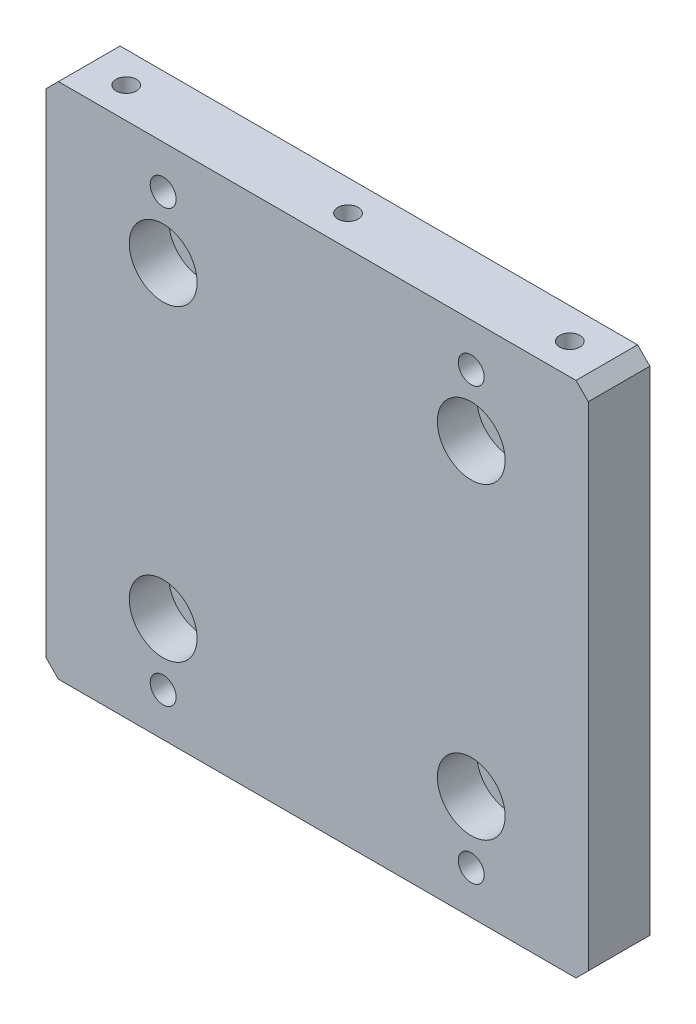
from build123d import *

# Parameters (mm, degrees)
ESQUISSE1_W                                        = 88
ESQUISSE1_H                                        = 84
BOSS_EXTRU_1_DEPTH                                 = 10
CHAMBRAGE_POUR_VIS_T_TE_HEXAGONALE_M61_D           = 6.4
CHAMBRAGE_POUR_VIS_T_TE_HEXAGONALE_M61_CBORE_D     = 11
CHAMBRAGE_POUR_VIS_T_TE_HEXAGONALE_M61_CBORE_DEPTH = 6.4
TROU_TARAUD_M51_D                                  = 4.2
CHANFREIN1_SIZE                                    = 2
TROU_TARAUD_M4X0_71_D                              = 3.3
TROU_TARAUD_M4X0_71_DEPTH                          = 13.5
TROU_TARAUD_M4X0_71_TIP                            = 0.991420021


with BuildPart() as part:
    # Esquisse1 → Boss.-Extru.1 (new body)
    with BuildSketch(Plane.XY):
        Rectangle(ESQUISSE1_W, ESQUISSE1_H)
    extrude(amount=BOSS_EXTRU_1_DEPTH)

    # Chambrage pour vis _ t_te hexagonale M61 (through all)
    with Locations(Plane.XY.offset(10)):
        with Locations((-25, 25), (25, 25), (25, -25), (-25, -25)):
            CounterBoreHole(CHAMBRAGE_POUR_VIS_T_TE_HEXAGONALE_M61_D / 2, CHAMBRAGE_POUR_VIS_T_TE_HEXAGONALE_M61_CBORE_D / 2, CHAMBRAGE_POUR_VIS_T_TE_HEXAGONALE_M61_CBORE_DEPTH)

    # Trou taraud_ M51 (through all)
    with Locations(Plane.XY.offset(10)):
        with Locations((-25, 35), (25, 35), (25, -35), (-25, -35)):
            Hole(TROU_TARAUD_M51_D / 2)

    # Chanfrein1
    chanfrein1_edges = [part.edges().sort_by_distance(p)[0] for p in [
        (-44, 42, 5),
        (44, 42, 5),
        (44, -42, 5),
        (-44, -42, 5),
    ]]
    chamfer(chanfrein1_edges, length=CHANFREIN1_SIZE)

    # Trou taraud_ M4x0.71
    with Locations(Plane(origin=(0, 42, 0), x_dir=(1, 0, 0), z_dir=(0, 1, 0))):
        with Locations((36, -5), (0, -5), (-36, -5)):
            Hole(TROU_TARAUD_M4X0_71_D / 2, depth=TROU_TARAUD_M4X0_71_DEPTH)
            with Locations((0, 0, -(TROU_TARAUD_M4X0_71_DEPTH + TROU_TARAUD_M4X0_71_TIP / 2))):  # 118° drill point
                Cone(0, TROU_TARAUD_M4X0_71_D / 2, TROU_TARAUD_M4X0_71_TIP, mode=Mode.SUBTRACT)


solid = part.part
